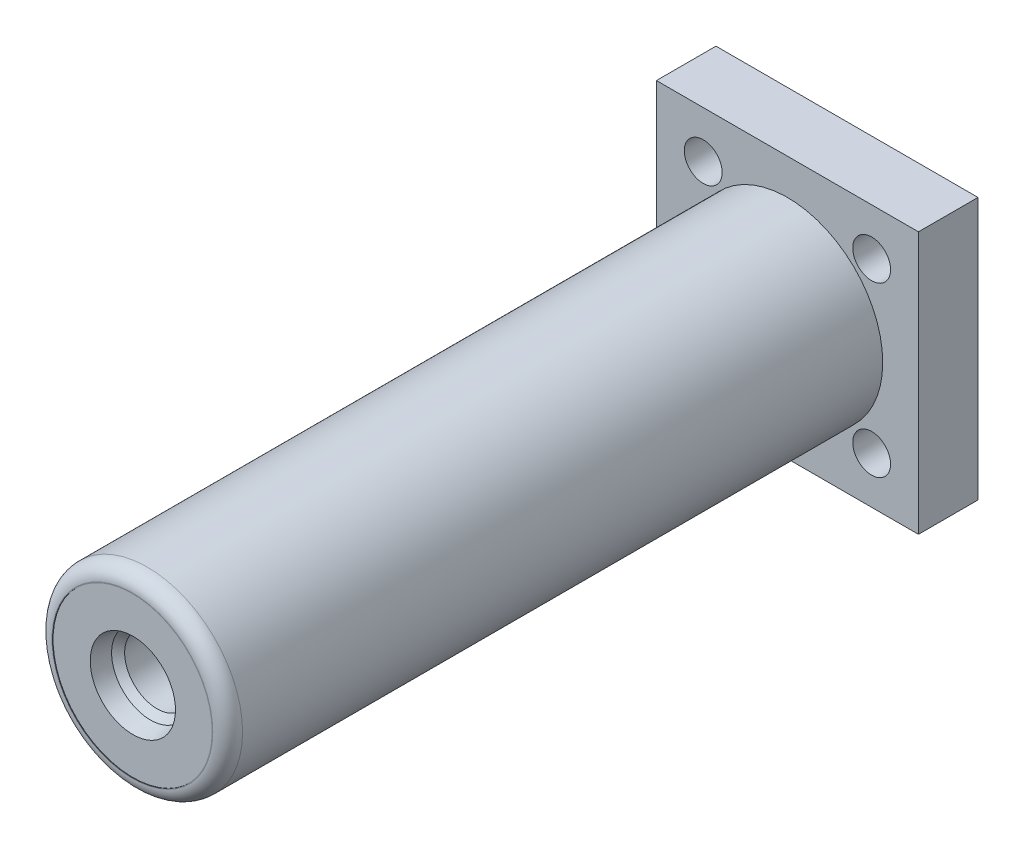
from build123d import *

# Parameters (mm, degrees)
SKETCH1_W              = 27.94
SKETCH1_H              = 27.94
BASE_DEPTH             = 6.35
SKETCH2_R              = 10.16
CYLINDER_DEPTH         = 69.85
SKETCH3_R              = 5.715
BORE_DEPTH             = 60.96
SKETCH4_R              = 7.1374
ORING_BORE_DEPTH       = 8.128
SKETCH5_R              = 2.0193
BOLT_CIRCLE_DEPTH      = 73.590249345
SKETCH6_R              = 2.38125
SIDE_PORT_DEPTH        = 16.002
SKETCH7_R              = 3.175
SIDE_WELD_DEPTH        = 8.89
SKETCH8_R              = 3.175
CENTER_HOLE_DEPTH      = 8.89
FILLET1_R              = 1.5875
SKETCH21_R             = 3.4544
THRU_HOLE_DEPTH        = 25.4
SKETCH31_R             = 8.509
LAND_DEPTH             = 0.0508
SKETCH41_R             = 4.5466
F_12_DEG_CHAMFER_DEPTH = 1.8796
F_12_DEG_CHAMFER_DRAFT = -12
SKETCH51_R             = 4.1529
F_45_DEG_CHAMFER_DEPTH = 2.54
F_45_DEG_CHAMFER_DRAFT = -45
CHAMFER1_SIZE          = 1.016
CHAMFER1_SIZE2         = 0.27223638


with BuildPart() as part:
    # Sketch1 → base (new body)
    with BuildSketch(Plane.XY):
        Rectangle(SKETCH1_W, SKETCH1_H)
    extrude(amount=BASE_DEPTH)

    # Sketch2 → cylinder (add)
    with BuildSketch(Plane.XY.offset(6.35)):
        Circle(SKETCH2_R)
    extrude(amount=CYLINDER_DEPTH)

    # Sketch3 → bore (cut)
    with BuildSketch(Plane(origin=(0, 0, 0), x_dir=(-1, 0, 0), z_dir=(0, 0, -1))):
        Circle(SKETCH3_R)
    extrude(amount=-BORE_DEPTH, mode=Mode.SUBTRACT)

    # Sketch4 → oring_bore (cut)
    with BuildSketch(Plane(origin=(0, 0, 0), x_dir=(-1, 0, 0), z_dir=(0, 0, -1))):
        Circle(SKETCH4_R)
    extrude(amount=-ORING_BORE_DEPTH, mode=Mode.SUBTRACT)

    # Sketch5 → bolt_circle (cut, through all)
    with BuildSketch(Plane.XY.offset(6.35)):
        with Locations((8.980256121, 8.980256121)):
            Circle(SKETCH5_R)
        with Locations((8.980256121, -8.980256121)):
            Circle(SKETCH5_R)
        with Locations((-8.980256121, -8.980256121)):
            Circle(SKETCH5_R)
        with Locations((-8.980256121, 8.980256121)):
            Circle(SKETCH5_R)
    extrude(amount=-BOLT_CIRCLE_DEPTH, mode=Mode.SUBTRACT)

    # Sketch6 → side_port (cut)
    with BuildSketch(Plane.ZY.offset(13.97)):
        with Locations((67.31, 0)):
            Circle(SKETCH6_R)
    extrude(amount=-SIDE_PORT_DEPTH, mode=Mode.SUBTRACT)

    # Sketch7 → side_weld (cut)
    with BuildSketch(Plane.ZY.offset(13.97)):
        with Locations((67.31, 0)):
            Circle(SKETCH7_R)
    extrude(amount=-SIDE_WELD_DEPTH, mode=Mode.SUBTRACT)

    # Sketch8 → center_hole (cut)
    with BuildSketch(Plane(origin=(0, 0, 60.96), x_dir=(-1, 0, 0), z_dir=(0, 0, -1))):
        Circle(SKETCH8_R)
    extrude(amount=-CENTER_HOLE_DEPTH, mode=Mode.SUBTRACT)

    # Fillet1
    fillet1_edges = [part.edges().sort_by_distance(p)[0] for p in [
        (-10.16, 0, 76.2),
    ]]
    fillet(fillet1_edges, radius=FILLET1_R)

    # Sketch21 → thru_hole (cut)
    with BuildSketch(Plane(origin=(3.80842627, 0.224025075, 76.2), x_dir=(1, 0, 0), z_dir=(0, 0, 1))):
        with Locations((-3.80842627, -0.224025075)):
            Circle(SKETCH21_R)
    extrude(amount=-THRU_HOLE_DEPTH, mode=Mode.SUBTRACT)

    # Sketch31 → land (cut)
    with BuildSketch(Plane.XY.offset(76.2)):
        Circle(SKETCH31_R)
    extrude(amount=-LAND_DEPTH, mode=Mode.SUBTRACT)


with BuildPart() as f_12_deg_chamfer_tool:
    # Sketch41 → 12_deg_chamfer (with draft: the straight prism first)
    with BuildSketch(Plane.XY.offset(76.1492)):
        Circle(SKETCH41_R)
    extrude(amount=-F_12_DEG_CHAMFER_DEPTH)
    # 12_deg_chamfer: the draft: its side faces are tilted about the plane it starts from
    f_12_deg_chamfer_sides = [f_12_deg_chamfer_tool.faces().sort_by_distance(p)[0] for p in [
        (-4.5466, 0, 75.2094),
    ]]
    draft(f_12_deg_chamfer_sides, Plane.XY.offset(76.1492), F_12_DEG_CHAMFER_DRAFT)


with BuildPart() as part_1:
    add(part.part)

    # 12_deg_chamfer: cut by f_12_deg_chamfer_tool
    add(f_12_deg_chamfer_tool.part, mode=Mode.SUBTRACT)


with BuildPart() as f_45_deg_chamfer_tool:
    # Sketch51 → 45_deg_chamfer (with draft: the straight prism first)
    with BuildSketch(Plane.XY.offset(74.2696)):
        Circle(SKETCH51_R)
    extrude(amount=-F_45_DEG_CHAMFER_DEPTH)
    # 45_deg_chamfer: the draft: its side faces are tilted about the plane it starts from
    f_45_deg_chamfer_sides = [f_45_deg_chamfer_tool.faces().sort_by_distance(p)[0] for p in [
        (-4.1529, 0, 72.9996),
    ]]
    draft(f_45_deg_chamfer_sides, Plane.XY.offset(74.2696), F_45_DEG_CHAMFER_DRAFT)


with BuildPart() as part_2:
    add(part_1.part)

    # 45_deg_chamfer: cut by f_45_deg_chamfer_tool
    add(f_45_deg_chamfer_tool.part, mode=Mode.SUBTRACT)

    # Chamfer1
    chamfer1_edges = [part_2.edges().sort_by_distance(p)[0] for p in [
        (7.1374, 0, 0),
    ]]
    chamfer1_side = [part_2.faces().sort_by_distance(p)[0] for p in [
        (7.1374, 0, 4.064),
    ]]
    chamfer(chamfer1_edges, length=CHAMFER1_SIZE, length2=CHAMFER1_SIZE2, reference=chamfer1_side[0])


solid = part_2.part
